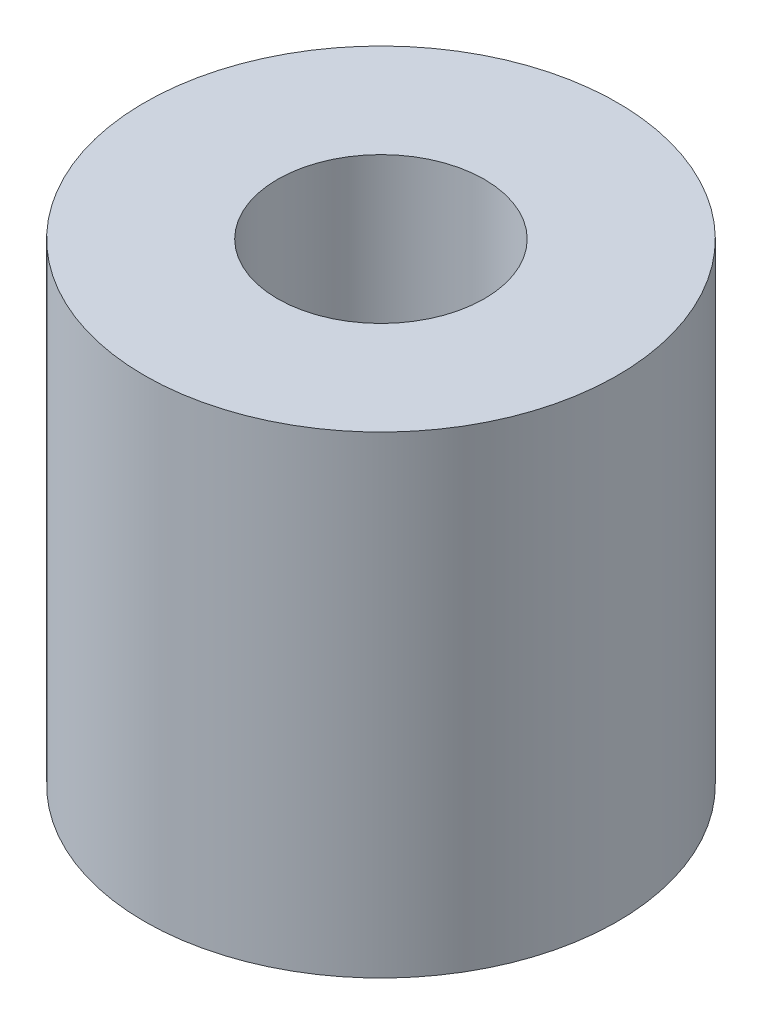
ISO-10303-21;
HEADER;
FILE_DESCRIPTION(('STEP AP214'),'2;1');
FILE_NAME('part.step','',(''),(''),'','','');
FILE_SCHEMA(('AUTOMOTIVE_DESIGN { 1 0 10303 214 1 1 1 1 }'));
ENDSEC;
DATA;
#1=APPLICATION_CONTEXT('core data for automotive mechanical design processes');
#2=APPLICATION_PROTOCOL_DEFINITION('international standard','automotive_design',2000,#1);
#3=PRODUCT_CONTEXT('',#1,'mechanical');
#4=PRODUCT('Part','Part','',(#3));
#5=PRODUCT_RELATED_PRODUCT_CATEGORY('part','',(#4));
#6=PRODUCT_DEFINITION_FORMATION('','',#4);
#7=PRODUCT_DEFINITION_CONTEXT('part definition',#1,'design');
#8=PRODUCT_DEFINITION('design','',#6,#7);
#9=PRODUCT_DEFINITION_SHAPE('','',#8);
#10=(LENGTH_UNIT() NAMED_UNIT(*) SI_UNIT(.MILLI.,.METRE.));
#11=(NAMED_UNIT(*) PLANE_ANGLE_UNIT() SI_UNIT($,.RADIAN.));
#12=(NAMED_UNIT(*) SI_UNIT($,.STERADIAN.) SOLID_ANGLE_UNIT());
#13=UNCERTAINTY_MEASURE_WITH_UNIT(LENGTH_MEASURE(1.E-05),#10,'distance_accuracy_value','');
#14=(GEOMETRIC_REPRESENTATION_CONTEXT(3) GLOBAL_UNCERTAINTY_ASSIGNED_CONTEXT((#13)) GLOBAL_UNIT_ASSIGNED_CONTEXT((#10,
#11,#12)) REPRESENTATION_CONTEXT('',''));
#15=CARTESIAN_POINT('',(0.,0.,0.));
#16=DIRECTION('',(0.,0.,1.));
#17=DIRECTION('',(1.,0.,0.));
#18=AXIS2_PLACEMENT_3D('',#15,#16,#17);
#19=CARTESIAN_POINT('',(0.,8.,0.));
#20=DIRECTION('',(0.,1.,0.));
#21=DIRECTION('',(0.,0.,1.));
#22=AXIS2_PLACEMENT_3D('',#19,#20,#21);
#23=PLANE('',#22);
#24=CARTESIAN_POINT('',(0.,8.,0.));
#25=DIRECTION('',(0.,1.,0.));
#26=DIRECTION('',(0.,0.,1.));
#27=AXIS2_PLACEMENT_3D('',#24,#25,#26);
#28=CIRCLE('',#27,4.);
#29=CARTESIAN_POINT('',(0.,8.,4.));
#30=VERTEX_POINT('',#29);
#31=EDGE_CURVE('E10',#30,#30,#28,.T.);
#32=ORIENTED_EDGE('',*,*,#31,.T.);
#33=EDGE_LOOP('',(#32));
#34=FACE_BOUND('',#33,.T.);
#35=CARTESIAN_POINT('',(0.,8.,0.));
#36=DIRECTION('',(0.,1.,0.));
#37=DIRECTION('',(0.,0.,1.));
#38=AXIS2_PLACEMENT_3D('',#35,#36,#37);
#39=CIRCLE('',#38,1.75);
#40=CARTESIAN_POINT('',(0.,8.,1.75));
#41=VERTEX_POINT('',#40);
#42=EDGE_CURVE('E42',#41,#41,#39,.T.);
#43=ORIENTED_EDGE('',*,*,#42,.F.);
#44=EDGE_LOOP('',(#43));
#45=FACE_BOUND('',#44,.T.);
#46=ADVANCED_FACE('F31',(#34,#45),#23,.T.);
#47=CARTESIAN_POINT('',(0.,0.,0.));
#48=DIRECTION('',(0.,1.,0.));
#49=DIRECTION('',(0.,0.,1.));
#50=AXIS2_PLACEMENT_3D('',#47,#48,#49);
#51=PLANE('',#50);
#52=CARTESIAN_POINT('',(0.,0.,0.));
#53=DIRECTION('',(0.,1.,0.));
#54=DIRECTION('',(0.,0.,1.));
#55=AXIS2_PLACEMENT_3D('',#52,#53,#54);
#56=CIRCLE('',#55,4.);
#57=CARTESIAN_POINT('',(0.,0.,4.));
#58=VERTEX_POINT('',#57);
#59=EDGE_CURVE('E35',#58,#58,#56,.T.);
#60=ORIENTED_EDGE('',*,*,#59,.F.);
#61=EDGE_LOOP('',(#60));
#62=FACE_BOUND('',#61,.T.);
#63=CARTESIAN_POINT('',(0.,0.,0.));
#64=DIRECTION('',(0.,1.,0.));
#65=DIRECTION('',(0.,0.,1.));
#66=AXIS2_PLACEMENT_3D('',#63,#64,#65);
#67=CIRCLE('',#66,1.75);
#68=CARTESIAN_POINT('',(0.,0.,1.75));
#69=VERTEX_POINT('',#68);
#70=EDGE_CURVE('E44',#69,#69,#67,.T.);
#71=ORIENTED_EDGE('',*,*,#70,.T.);
#72=EDGE_LOOP('',(#71));
#73=FACE_BOUND('',#72,.T.);
#74=ADVANCED_FACE('F54',(#62,#73),#51,.F.);
#75=CARTESIAN_POINT('',(0.,8.,0.));
#76=DIRECTION('',(0.,-1.,0.));
#77=DIRECTION('',(0.,0.,-1.));
#78=AXIS2_PLACEMENT_3D('',#75,#76,#77);
#79=CYLINDRICAL_SURFACE('',#78,4.);
#80=ORIENTED_EDGE('',*,*,#31,.F.);
#81=EDGE_LOOP('',(#80));
#82=FACE_BOUND('',#81,.T.);
#83=ORIENTED_EDGE('',*,*,#59,.T.);
#84=EDGE_LOOP('',(#83));
#85=FACE_BOUND('',#84,.T.);
#86=ADVANCED_FACE('F33',(#82,#85),#79,.T.);
#87=CARTESIAN_POINT('',(0.,8.,0.));
#88=DIRECTION('',(0.,-1.,0.));
#89=DIRECTION('',(0.,0.,-1.));
#90=AXIS2_PLACEMENT_3D('',#87,#88,#89);
#91=CYLINDRICAL_SURFACE('',#90,1.75);
#92=ORIENTED_EDGE('',*,*,#42,.T.);
#93=EDGE_LOOP('',(#92));
#94=FACE_BOUND('',#93,.T.);
#95=ORIENTED_EDGE('',*,*,#70,.F.);
#96=EDGE_LOOP('',(#95));
#97=FACE_BOUND('',#96,.T.);
#98=ADVANCED_FACE('F50',(#94,#97),#91,.F.);
#99=CLOSED_SHELL('',(#46,#74,#86,#98));
#100=MANIFOLD_SOLID_BREP('B2',#99);
#101=ADVANCED_BREP_SHAPE_REPRESENTATION('',(#18,#100),#14);
#102=SHAPE_DEFINITION_REPRESENTATION(#9,#101);
ENDSEC;
END-ISO-10303-21;
